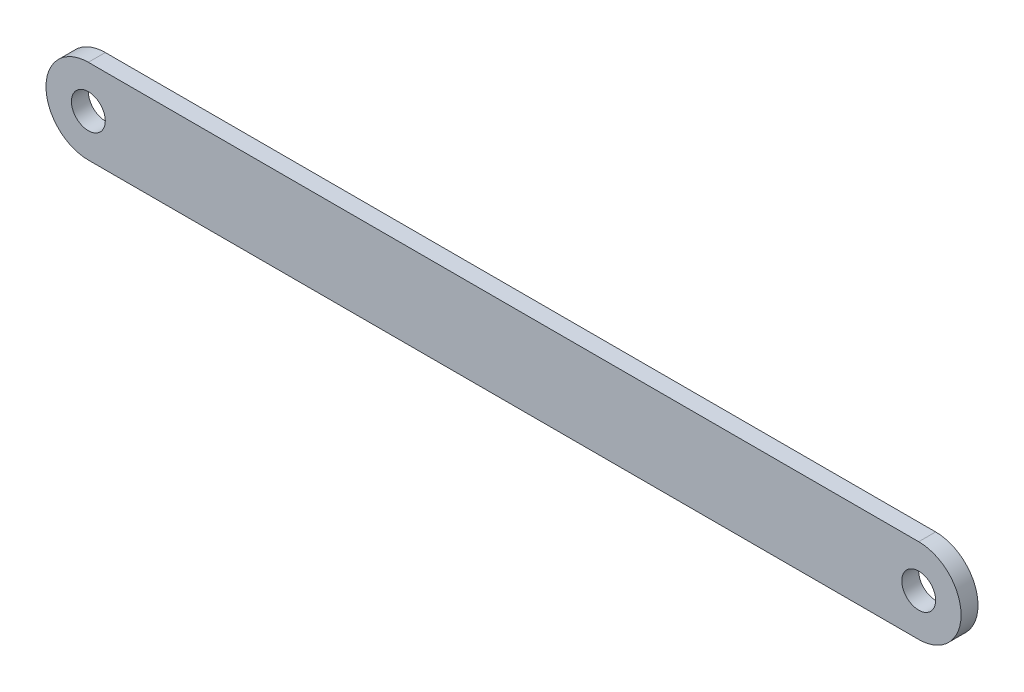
ISO-10303-21;
HEADER;
FILE_DESCRIPTION(('STEP AP214'),'2;1');
FILE_NAME('part.step','',(''),(''),'','','');
FILE_SCHEMA(('AUTOMOTIVE_DESIGN { 1 0 10303 214 1 1 1 1 }'));
ENDSEC;
DATA;
#1=APPLICATION_CONTEXT('core data for automotive mechanical design processes');
#2=APPLICATION_PROTOCOL_DEFINITION('international standard','automotive_design',2000,#1);
#3=PRODUCT_CONTEXT('',#1,'mechanical');
#4=PRODUCT('Part','Part','',(#3));
#5=PRODUCT_RELATED_PRODUCT_CATEGORY('part','',(#4));
#6=PRODUCT_DEFINITION_FORMATION('','',#4);
#7=PRODUCT_DEFINITION_CONTEXT('part definition',#1,'design');
#8=PRODUCT_DEFINITION('design','',#6,#7);
#9=PRODUCT_DEFINITION_SHAPE('','',#8);
#10=(LENGTH_UNIT() NAMED_UNIT(*) SI_UNIT(.MILLI.,.METRE.));
#11=(NAMED_UNIT(*) PLANE_ANGLE_UNIT() SI_UNIT($,.RADIAN.));
#12=(NAMED_UNIT(*) SI_UNIT($,.STERADIAN.) SOLID_ANGLE_UNIT());
#13=UNCERTAINTY_MEASURE_WITH_UNIT(LENGTH_MEASURE(1.E-05),#10,'distance_accuracy_value','');
#14=(GEOMETRIC_REPRESENTATION_CONTEXT(3) GLOBAL_UNCERTAINTY_ASSIGNED_CONTEXT((#13)) GLOBAL_UNIT_ASSIGNED_CONTEXT((#10,
#11,#12)) REPRESENTATION_CONTEXT('',''));
#15=CARTESIAN_POINT('',(0.,0.,0.));
#16=DIRECTION('',(0.,0.,1.));
#17=DIRECTION('',(1.,0.,0.));
#18=AXIS2_PLACEMENT_3D('',#15,#16,#17);
#19=CARTESIAN_POINT('',(-122.5469967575,12.5,5.));
#20=DIRECTION('',(0.,1.,0.));
#21=DIRECTION('',(-1.,0.,0.));
#22=AXIS2_PLACEMENT_3D('',#19,#20,#21);
#23=PLANE('',#22);
#24=DIRECTION('',(1.,0.,0.));
#25=VECTOR('',#24,1.);
#26=CARTESIAN_POINT('',(-122.5469967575,12.5,0.));
#27=LINE('',#26,#25);
#28=CARTESIAN_POINT('',(-122.5469967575,12.5,0.));
#29=VERTEX_POINT('',#28);
#30=CARTESIAN_POINT('',(122.5469967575,12.5,0.));
#31=VERTEX_POINT('',#30);
#32=EDGE_CURVE('E98',#29,#31,#27,.T.);
#33=ORIENTED_EDGE('',*,*,#32,.F.);
#34=DIRECTION('',(0.,0.,-1.));
#35=VECTOR('',#34,1.);
#36=CARTESIAN_POINT('',(-122.5469967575,12.5,5.));
#37=LINE('',#36,#35);
#38=CARTESIAN_POINT('',(-122.5469967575,12.5,5.));
#39=VERTEX_POINT('',#38);
#40=EDGE_CURVE('E11',#39,#29,#37,.T.);
#41=ORIENTED_EDGE('',*,*,#40,.F.);
#42=DIRECTION('',(1.,0.,0.));
#43=VECTOR('',#42,1.);
#44=CARTESIAN_POINT('',(-122.5469967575,12.5,5.));
#45=LINE('',#44,#43);
#46=CARTESIAN_POINT('',(122.5469967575,12.5,5.));
#47=VERTEX_POINT('',#46);
#48=EDGE_CURVE('E92',#39,#47,#45,.T.);
#49=ORIENTED_EDGE('',*,*,#48,.T.);
#50=DIRECTION('',(0.,0.,-1.));
#51=VECTOR('',#50,1.);
#52=CARTESIAN_POINT('',(122.5469967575,12.5,5.));
#53=LINE('',#52,#51);
#54=EDGE_CURVE('E35',#47,#31,#53,.T.);
#55=ORIENTED_EDGE('',*,*,#54,.T.);
#56=EDGE_LOOP('',(#33,#41,#49,#55));
#57=FACE_BOUND('',#56,.T.);
#58=ADVANCED_FACE('F32',(#57),#23,.T.);
#59=CARTESIAN_POINT('',(-122.5469967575,0.,5.));
#60=DIRECTION('',(0.,0.,-1.));
#61=DIRECTION('',(-1.,0.,0.));
#62=AXIS2_PLACEMENT_3D('',#59,#60,#61);
#63=CYLINDRICAL_SURFACE('',#62,12.5);
#64=CARTESIAN_POINT('',(-122.5469967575,0.,0.));
#65=DIRECTION('',(0.,0.,1.));
#66=DIRECTION('',(1.,0.,0.));
#67=AXIS2_PLACEMENT_3D('',#64,#65,#66);
#68=CIRCLE('',#67,12.5);
#69=CARTESIAN_POINT('',(-122.5469967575,-12.5,0.));
#70=VERTEX_POINT('',#69);
#71=EDGE_CURVE('E65',#29,#70,#68,.T.);
#72=ORIENTED_EDGE('',*,*,#71,.T.);
#73=DIRECTION('',(0.,0.,-1.));
#74=VECTOR('',#73,1.);
#75=CARTESIAN_POINT('',(-122.5469967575,-12.5,5.));
#76=LINE('',#75,#74);
#77=CARTESIAN_POINT('',(-122.5469967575,-12.5,5.));
#78=VERTEX_POINT('',#77);
#79=EDGE_CURVE('E41',#78,#70,#76,.T.);
#80=ORIENTED_EDGE('',*,*,#79,.F.);
#81=CARTESIAN_POINT('',(-122.5469967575,0.,5.));
#82=DIRECTION('',(0.,0.,1.));
#83=DIRECTION('',(1.,0.,0.));
#84=AXIS2_PLACEMENT_3D('',#81,#82,#83);
#85=CIRCLE('',#84,12.5);
#86=EDGE_CURVE('E80',#39,#78,#85,.T.);
#87=ORIENTED_EDGE('',*,*,#86,.F.);
#88=ORIENTED_EDGE('',*,*,#40,.T.);
#89=EDGE_LOOP('',(#72,#80,#87,#88));
#90=FACE_BOUND('',#89,.T.);
#91=ADVANCED_FACE('F109',(#90),#63,.T.);
#92=CARTESIAN_POINT('',(-122.5469967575,-12.5,5.));
#93=DIRECTION('',(0.,1.,0.));
#94=DIRECTION('',(-1.,0.,0.));
#95=AXIS2_PLACEMENT_3D('',#92,#93,#94);
#96=PLANE('',#95);
#97=DIRECTION('',(1.,0.,0.));
#98=VECTOR('',#97,1.);
#99=CARTESIAN_POINT('',(-122.5469967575,-12.5,0.));
#100=LINE('',#99,#98);
#101=CARTESIAN_POINT('',(122.5469967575,-12.5,0.));
#102=VERTEX_POINT('',#101);
#103=EDGE_CURVE('E87',#70,#102,#100,.T.);
#104=ORIENTED_EDGE('',*,*,#103,.T.);
#105=DIRECTION('',(0.,0.,-1.));
#106=VECTOR('',#105,1.);
#107=CARTESIAN_POINT('',(122.5469967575,-12.5,5.));
#108=LINE('',#107,#106);
#109=CARTESIAN_POINT('',(122.5469967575,-12.5,5.));
#110=VERTEX_POINT('',#109);
#111=EDGE_CURVE('E84',#110,#102,#108,.T.);
#112=ORIENTED_EDGE('',*,*,#111,.F.);
#113=DIRECTION('',(1.,0.,0.));
#114=VECTOR('',#113,1.);
#115=CARTESIAN_POINT('',(-122.5469967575,-12.5,5.));
#116=LINE('',#115,#114);
#117=EDGE_CURVE('E77',#78,#110,#116,.T.);
#118=ORIENTED_EDGE('',*,*,#117,.F.);
#119=ORIENTED_EDGE('',*,*,#79,.T.);
#120=EDGE_LOOP('',(#104,#112,#118,#119));
#121=FACE_BOUND('',#120,.T.);
#122=ADVANCED_FACE('F85',(#121),#96,.F.);
#123=CARTESIAN_POINT('',(122.5469967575,0.,5.));
#124=DIRECTION('',(0.,0.,-1.));
#125=DIRECTION('',(-1.,0.,0.));
#126=AXIS2_PLACEMENT_3D('',#123,#124,#125);
#127=CYLINDRICAL_SURFACE('',#126,12.5);
#128=CARTESIAN_POINT('',(122.5469967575,0.,0.));
#129=DIRECTION('',(0.,0.,1.));
#130=DIRECTION('',(1.,0.,0.));
#131=AXIS2_PLACEMENT_3D('',#128,#129,#130);
#132=CIRCLE('',#131,12.5);
#133=EDGE_CURVE('E101',#102,#31,#132,.T.);
#134=ORIENTED_EDGE('',*,*,#133,.T.);
#135=ORIENTED_EDGE('',*,*,#54,.F.);
#136=CARTESIAN_POINT('',(122.5469967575,0.,5.));
#137=DIRECTION('',(0.,0.,1.));
#138=DIRECTION('',(1.,0.,0.));
#139=AXIS2_PLACEMENT_3D('',#136,#137,#138);
#140=CIRCLE('',#139,12.5);
#141=EDGE_CURVE('E74',#110,#47,#140,.T.);
#142=ORIENTED_EDGE('',*,*,#141,.F.);
#143=ORIENTED_EDGE('',*,*,#111,.T.);
#144=EDGE_LOOP('',(#134,#135,#142,#143));
#145=FACE_BOUND('',#144,.T.);
#146=ADVANCED_FACE('F91',(#145),#127,.T.);
#147=CARTESIAN_POINT('',(122.5469967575,0.,5.));
#148=DIRECTION('',(0.,0.,1.));
#149=DIRECTION('',(1.,0.,0.));
#150=AXIS2_PLACEMENT_3D('',#147,#148,#149);
#151=PLANE('',#150);
#152=CARTESIAN_POINT('',(122.5469967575,0.,5.));
#153=DIRECTION('',(0.,0.,1.));
#154=DIRECTION('',(1.,0.,0.));
#155=AXIS2_PLACEMENT_3D('',#152,#153,#154);
#156=CIRCLE('',#155,5.);
#157=CARTESIAN_POINT('',(127.5469967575,0.,5.));
#158=VERTEX_POINT('',#157);
#159=EDGE_CURVE('E146',#158,#158,#156,.T.);
#160=ORIENTED_EDGE('',*,*,#159,.F.);
#161=EDGE_LOOP('',(#160));
#162=FACE_BOUND('',#161,.T.);
#163=CARTESIAN_POINT('',(-122.5469967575,0.,5.));
#164=DIRECTION('',(0.,0.,1.));
#165=DIRECTION('',(1.,0.,0.));
#166=AXIS2_PLACEMENT_3D('',#163,#164,#165);
#167=CIRCLE('',#166,5.);
#168=CARTESIAN_POINT('',(-117.5469967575,0.,5.));
#169=VERTEX_POINT('',#168);
#170=EDGE_CURVE('E148',#169,#169,#167,.T.);
#171=ORIENTED_EDGE('',*,*,#170,.F.);
#172=EDGE_LOOP('',(#171));
#173=FACE_BOUND('',#172,.T.);
#174=ORIENTED_EDGE('',*,*,#48,.F.);
#175=ORIENTED_EDGE('',*,*,#86,.T.);
#176=ORIENTED_EDGE('',*,*,#117,.T.);
#177=ORIENTED_EDGE('',*,*,#141,.T.);
#178=EDGE_LOOP('',(#174,#175,#176,#177));
#179=FACE_BOUND('',#178,.T.);
#180=ADVANCED_FACE('F79',(#162,#173,#179),#151,.T.);
#181=CARTESIAN_POINT('',(122.5469967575,0.,0.));
#182=DIRECTION('',(0.,0.,1.));
#183=DIRECTION('',(1.,0.,0.));
#184=AXIS2_PLACEMENT_3D('',#181,#182,#183);
#185=PLANE('',#184);
#186=CARTESIAN_POINT('',(122.5469967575,0.,0.));
#187=DIRECTION('',(0.,0.,1.));
#188=DIRECTION('',(1.,0.,0.));
#189=AXIS2_PLACEMENT_3D('',#186,#187,#188);
#190=CIRCLE('',#189,5.);
#191=CARTESIAN_POINT('',(127.5469967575,0.,0.));
#192=VERTEX_POINT('',#191);
#193=EDGE_CURVE('E144',#192,#192,#190,.T.);
#194=ORIENTED_EDGE('',*,*,#193,.T.);
#195=EDGE_LOOP('',(#194));
#196=FACE_BOUND('',#195,.T.);
#197=CARTESIAN_POINT('',(-122.5469967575,0.,0.));
#198=DIRECTION('',(0.,0.,1.));
#199=DIRECTION('',(1.,0.,0.));
#200=AXIS2_PLACEMENT_3D('',#197,#198,#199);
#201=CIRCLE('',#200,5.);
#202=CARTESIAN_POINT('',(-117.5469967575,0.,0.));
#203=VERTEX_POINT('',#202);
#204=EDGE_CURVE('E102',#203,#203,#201,.T.);
#205=ORIENTED_EDGE('',*,*,#204,.T.);
#206=EDGE_LOOP('',(#205));
#207=FACE_BOUND('',#206,.T.);
#208=ORIENTED_EDGE('',*,*,#32,.T.);
#209=ORIENTED_EDGE('',*,*,#133,.F.);
#210=ORIENTED_EDGE('',*,*,#103,.F.);
#211=ORIENTED_EDGE('',*,*,#71,.F.);
#212=EDGE_LOOP('',(#208,#209,#210,#211));
#213=FACE_BOUND('',#212,.T.);
#214=ADVANCED_FACE('F107',(#196,#207,#213),#185,.F.);
#215=CARTESIAN_POINT('',(-122.5469967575,0.,5.));
#216=DIRECTION('',(0.,0.,1.));
#217=DIRECTION('',(1.,0.,0.));
#218=AXIS2_PLACEMENT_3D('',#215,#216,#217);
#219=CYLINDRICAL_SURFACE('',#218,5.);
#220=ORIENTED_EDGE('',*,*,#204,.F.);
#221=EDGE_LOOP('',(#220));
#222=FACE_BOUND('',#221,.T.);
#223=ORIENTED_EDGE('',*,*,#170,.T.);
#224=EDGE_LOOP('',(#223));
#225=FACE_BOUND('',#224,.T.);
#226=ADVANCED_FACE('F128',(#222,#225),#219,.F.);
#227=CARTESIAN_POINT('',(122.5469967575,0.,5.));
#228=DIRECTION('',(0.,0.,1.));
#229=DIRECTION('',(1.,0.,0.));
#230=AXIS2_PLACEMENT_3D('',#227,#228,#229);
#231=CYLINDRICAL_SURFACE('',#230,5.);
#232=ORIENTED_EDGE('',*,*,#193,.F.);
#233=EDGE_LOOP('',(#232));
#234=FACE_BOUND('',#233,.T.);
#235=ORIENTED_EDGE('',*,*,#159,.T.);
#236=EDGE_LOOP('',(#235));
#237=FACE_BOUND('',#236,.T.);
#238=ADVANCED_FACE('F135',(#234,#237),#231,.F.);
#239=CLOSED_SHELL('',(#58,#91,#122,#146,#180,#214,#226,#238));
#240=MANIFOLD_SOLID_BREP('B2',#239);
#241=ADVANCED_BREP_SHAPE_REPRESENTATION('',(#18,#240),#14);
#242=SHAPE_DEFINITION_REPRESENTATION(#9,#241);
ENDSEC;
END-ISO-10303-21;
